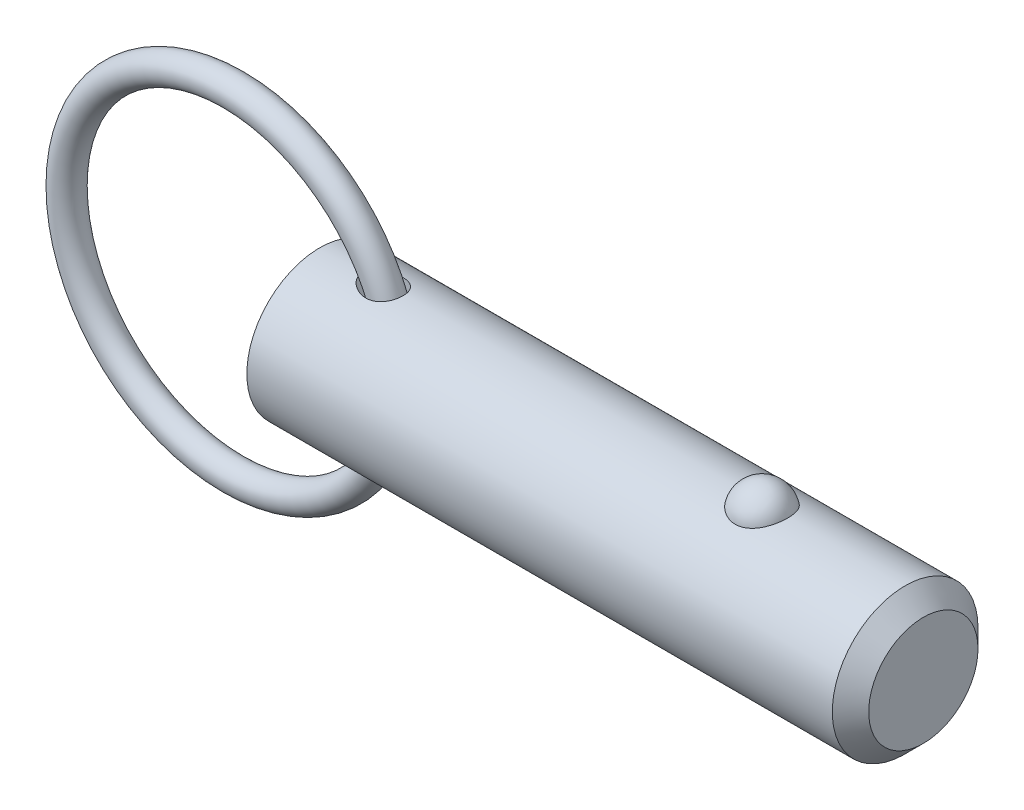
ISO-10303-21;
HEADER;
FILE_DESCRIPTION(('STEP AP214'),'2;1');
FILE_NAME('part.step','',(''),(''),'','','');
FILE_SCHEMA(('AUTOMOTIVE_DESIGN { 1 0 10303 214 1 1 1 1 }'));
ENDSEC;
DATA;
#1=APPLICATION_CONTEXT('core data for automotive mechanical design processes');
#2=APPLICATION_PROTOCOL_DEFINITION('international standard','automotive_design',2000,#1);
#3=PRODUCT_CONTEXT('',#1,'mechanical');
#4=PRODUCT('Part','Part','',(#3));
#5=PRODUCT_RELATED_PRODUCT_CATEGORY('part','',(#4));
#6=PRODUCT_DEFINITION_FORMATION('','',#4);
#7=PRODUCT_DEFINITION_CONTEXT('part definition',#1,'design');
#8=PRODUCT_DEFINITION('design','',#6,#7);
#9=PRODUCT_DEFINITION_SHAPE('','',#8);
#10=(LENGTH_UNIT() NAMED_UNIT(*) SI_UNIT(.MILLI.,.METRE.));
#11=(NAMED_UNIT(*) PLANE_ANGLE_UNIT() SI_UNIT($,.RADIAN.));
#12=(NAMED_UNIT(*) SI_UNIT($,.STERADIAN.) SOLID_ANGLE_UNIT());
#13=UNCERTAINTY_MEASURE_WITH_UNIT(LENGTH_MEASURE(1.E-05),#10,'distance_accuracy_value','');
#14=(GEOMETRIC_REPRESENTATION_CONTEXT(3) GLOBAL_UNCERTAINTY_ASSIGNED_CONTEXT((#13)) GLOBAL_UNIT_ASSIGNED_CONTEXT((#10,
#11,#12)) REPRESENTATION_CONTEXT('',''));
#15=CARTESIAN_POINT('',(0.,0.,0.));
#16=DIRECTION('',(0.,0.,1.));
#17=DIRECTION('',(1.,0.,0.));
#18=AXIS2_PLACEMENT_3D('',#15,#16,#17);
#19=CARTESIAN_POINT('',(-6.5973878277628,0.,0.));
#20=DIRECTION('',(0.,0.,1.));
#21=DIRECTION('',(1.,0.,0.));
#22=AXIS2_PLACEMENT_3D('',#19,#20,#21);
#23=TOROIDAL_SURFACE('',#22,12.7,1.111);
#24=CARTESIAN_POINT('',(7.21361217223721,0.,0.));
#25=VERTEX_POINT('',#24);
#26=VERTEX_LOOP('',#25);
#27=FACE_BOUND('',#26,.T.);
#28=ADVANCED_FACE('P0_F12',(#27),#23,.T.);
#29=CLOSED_SHELL('',(#28));
#30=MANIFOLD_SOLID_BREP('P0_B1',#29);
#31=CARTESIAN_POINT('',(0.,0.,0.));
#32=DIRECTION('',(1.,0.,0.));
#33=DIRECTION('',(0.,0.,-1.));
#34=AXIS2_PLACEMENT_3D('',#31,#32,#33);
#35=CYLINDRICAL_SURFACE('',#34,5.555);
#36=CARTESIAN_POINT('',(3.40796299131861,5.52646850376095,-0.562290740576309));
#37=CARTESIAN_POINT('',(3.45038002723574,5.51879026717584,-0.637753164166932));
#38=CARTESIAN_POINT('',(3.50032814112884,5.50998541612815,-0.70889136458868));
#39=CARTESIAN_POINT('',(3.61174203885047,5.49132550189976,-0.841353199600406));
#40=CARTESIAN_POINT('',(3.67323300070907,5.48146816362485,-0.90265482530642));
#41=CARTESIAN_POINT('',(3.80437942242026,5.46186986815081,-1.01449227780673));
#42=CARTESIAN_POINT('',(3.87396236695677,5.45212862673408,-1.06511378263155));
#43=CARTESIAN_POINT('',(4.01965973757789,5.43359578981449,-1.15594541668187));
#44=CARTESIAN_POINT('',(4.09577226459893,5.42480391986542,-1.19615855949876));
#45=CARTESIAN_POINT('',(4.26620236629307,5.40764958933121,-1.27165209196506));
#46=CARTESIAN_POINT('',(4.36143030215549,5.3996073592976,-1.30496908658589));
#47=CARTESIAN_POINT('',(4.55632904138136,5.38707461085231,-1.35578120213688));
#48=CARTESIAN_POINT('',(4.65600230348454,5.38258608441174,-1.37326745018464));
#49=CARTESIAN_POINT('',(4.85802759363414,5.37803111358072,-1.3910078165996));
#50=CARTESIAN_POINT('',(4.96039620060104,5.37800782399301,-1.39109376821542));
#51=CARTESIAN_POINT('',(5.1632196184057,5.38288845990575,-1.37209481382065));
#52=CARTESIAN_POINT('',(5.26367660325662,5.38778639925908,-1.3530331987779));
#53=CARTESIAN_POINT('',(5.44616808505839,5.40112654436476,-1.29866014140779));
#54=CARTESIAN_POINT('',(5.52893514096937,5.40904875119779,-1.26567968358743));
#55=CARTESIAN_POINT('',(5.68656142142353,5.4273273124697,-1.18484144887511));
#56=CARTESIAN_POINT('',(5.76142575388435,5.43768208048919,-1.13699336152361));
#57=CARTESIAN_POINT('',(5.89283785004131,5.45821422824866,-1.03362464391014));
#58=CARTESIAN_POINT('',(5.95048930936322,5.4682911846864,-0.979480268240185));
#59=CARTESIAN_POINT('',(6.05543937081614,5.48805232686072,-0.861887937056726));
#60=CARTESIAN_POINT('',(6.10274018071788,5.4977365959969,-0.798441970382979));
#61=CARTESIAN_POINT('',(6.18429732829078,5.51527779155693,-0.666351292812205));
#62=CARTESIAN_POINT('',(6.21893047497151,5.52318421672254,-0.597945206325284));
#63=CARTESIAN_POINT('',(6.27643902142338,5.53669785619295,-0.456146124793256));
#64=CARTESIAN_POINT('',(6.29931470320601,5.54230512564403,-0.382753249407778));
#65=CARTESIAN_POINT('',(6.33280284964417,5.55061821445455,-0.23299976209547));
#66=CARTESIAN_POINT('',(6.3434049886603,5.55332159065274,-0.156636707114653));
#67=CARTESIAN_POINT('',(6.35208224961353,5.55552923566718,-0.0031547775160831));
#68=CARTESIAN_POINT('',(6.35015703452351,5.55503341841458,0.0739641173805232));
#69=CARTESIAN_POINT('',(6.33379320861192,5.55088854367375,0.227029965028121));
#70=CARTESIAN_POINT('',(6.31931424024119,5.54722931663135,0.302972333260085));
#71=CARTESIAN_POINT('',(6.27810810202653,5.53713917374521,0.451265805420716));
#72=CARTESIAN_POINT('',(6.25138106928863,5.53070828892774,0.523616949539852));
#73=CARTESIAN_POINT('',(6.18634700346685,5.51578851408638,0.662556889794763));
#74=CARTESIAN_POINT('',(6.14805666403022,5.50730259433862,0.729153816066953));
#75=CARTESIAN_POINT('',(6.06084171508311,5.4892059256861,0.854797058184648));
#76=CARTESIAN_POINT('',(6.01191805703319,5.47959527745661,0.913844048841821));
#77=CARTESIAN_POINT('',(5.90496974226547,5.46035411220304,1.0225462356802));
#78=CARTESIAN_POINT('',(5.84698163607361,5.45072382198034,1.07223745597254));
#79=CARTESIAN_POINT('',(5.72342907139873,5.43245016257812,1.16128533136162));
#80=CARTESIAN_POINT('',(5.657864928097,5.42380675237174,1.20064241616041));
#81=CARTESIAN_POINT('',(5.5203318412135,5.40830592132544,1.26865612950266));
#82=CARTESIAN_POINT('',(5.44830127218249,5.40146883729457,1.2971923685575));
#83=CARTESIAN_POINT('',(5.30051649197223,5.39032432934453,1.34275086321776));
#84=CARTESIAN_POINT('',(5.22476137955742,5.38601752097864,1.35977031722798));
#85=CARTESIAN_POINT('',(5.06697568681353,5.38004503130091,1.3832203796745));
#86=CARTESIAN_POINT('',(4.98483834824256,5.37854992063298,1.38896799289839));
#87=CARTESIAN_POINT('',(4.82062075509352,5.37866467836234,1.38851901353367));
#88=CARTESIAN_POINT('',(4.73854053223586,5.38027567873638,1.38231806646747));
#89=CARTESIAN_POINT('',(4.56659703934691,5.38661928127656,1.35740374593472));
#90=CARTESIAN_POINT('',(4.47694676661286,5.39169506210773,1.33731128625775));
#91=CARTESIAN_POINT('',(4.30168169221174,5.40457769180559,1.28425210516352));
#92=CARTESIAN_POINT('',(4.21607146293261,5.41238755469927,1.25127117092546));
#93=CARTESIAN_POINT('',(4.04117722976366,5.43085841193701,1.16867508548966));
#94=CARTESIAN_POINT('',(3.95261220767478,5.44174460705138,1.11757796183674));
#95=CARTESIAN_POINT('',(3.78568183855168,5.46440376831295,1.00091858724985));
#96=CARTESIAN_POINT('',(3.70730710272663,5.47617590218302,0.935369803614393));
#97=CARTESIAN_POINT('',(3.58299379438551,5.49603821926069,0.809043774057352));
#98=CARTESIAN_POINT('',(3.53390203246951,5.50429522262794,0.751392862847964));
#99=CARTESIAN_POINT('',(3.44556991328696,5.51963490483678,0.628847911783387));
#100=CARTESIAN_POINT('',(3.4063138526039,5.52671944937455,0.563965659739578));
#101=CARTESIAN_POINT('',(3.34553998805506,5.5379053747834,0.439181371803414));
#102=CARTESIAN_POINT('',(3.32216705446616,5.5423057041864,0.380214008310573));
#103=CARTESIAN_POINT('',(3.2854368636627,5.54928356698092,0.259119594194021));
#104=CARTESIAN_POINT('',(3.27207322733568,5.5518622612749,0.196994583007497));
#105=CARTESIAN_POINT('',(3.25633559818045,5.5549036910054,0.0710541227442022));
#106=CARTESIAN_POINT('',(3.25400356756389,5.5553583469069,0.0072331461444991));
#107=CARTESIAN_POINT('',(3.26064251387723,5.55407150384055,-0.119787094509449));
#108=CARTESIAN_POINT('',(3.26961302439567,5.55233009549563,-0.182986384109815));
#109=CARTESIAN_POINT('',(3.29666795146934,5.54714559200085,-0.300518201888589));
#110=CARTESIAN_POINT('',(3.31373453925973,5.54389322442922,-0.355099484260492));
#111=CARTESIAN_POINT('',(3.35543396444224,5.53607951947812,-0.461174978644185));
#112=CARTESIAN_POINT('',(3.38007019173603,5.5315175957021,-0.512667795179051));
#113=CARTESIAN_POINT('',(3.40796299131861,5.52646850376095,-0.562290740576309));
#114=B_SPLINE_CURVE_WITH_KNOTS('',3,(#36,#37,#38,#39,#40,#41,#42,#43,#44,#45,#46,#47,#48,#49,
#50,#51,#52,#53,#54,#55,#56,#57,#58,#59,#60,#61,#62,#63,#64,#65,#66,#67,#68,#69,#70,#71,#72,#73,
#74,#75,#76,#77,#78,#79,#80,#81,#82,#83,#84,#85,#86,#87,#88,#89,#90,#91,#92,#93,#94,#95,#96,#97,
#98,#99,#100,#101,#102,#103,#104,#105,#106,#107,#108,#109,#110,#111,#112,#113),.UNSPECIFIED.,
.T.,.F.,(4,2,2,2,2,2,2,2,2,2,2,2,2,2,2,2,2,2,2,2,2,2,2,2,2,2,2,2,2,2,2,2,2,2,2,2,2,2,4),(0.,
0.260459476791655,0.52149382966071,0.780346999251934,1.03912513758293,1.34137402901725,
1.64379222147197,1.94913302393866,2.25410286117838,2.52092363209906,2.78757087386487,
3.02557563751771,3.26352958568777,3.49368251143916,3.72382991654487,3.9541708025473,
4.18451788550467,4.41560824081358,4.64669600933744,4.87745174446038,5.10818684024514,
5.33801446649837,5.56783253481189,5.80013729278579,6.03249854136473,6.27855081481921,
6.5246927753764,6.79963372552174,7.07487872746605,7.38193573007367,7.68870779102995,
7.91639390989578,8.14371416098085,8.33366541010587,8.52349549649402,8.71404708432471,
8.90459080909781,9.07578823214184,9.24706243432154),.UNSPECIFIED.);
#115=CARTESIAN_POINT('',(3.40796299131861,5.52646850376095,-0.562290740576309));
#116=VERTEX_POINT('',#115);
#117=EDGE_CURVE('P1_E40',#116,#116,#114,.T.);
#118=ORIENTED_EDGE('',*,*,#117,.T.);
#119=EDGE_LOOP('',(#118));
#120=FACE_BOUND('',#119,.T.);
#121=CARTESIAN_POINT('',(44.63125,0.,0.));
#122=DIRECTION('',(1.,0.,0.));
#123=DIRECTION('',(0.,0.,-1.));
#124=AXIS2_PLACEMENT_3D('',#121,#122,#123);
#125=CIRCLE('',#124,5.555);
#126=CARTESIAN_POINT('',(44.63125,0.,-5.555));
#127=VERTEX_POINT('',#126);
#128=EDGE_CURVE('P1_E25',#127,#127,#125,.T.);
#129=ORIENTED_EDGE('',*,*,#128,.F.);
#130=EDGE_LOOP('',(#129));
#131=FACE_BOUND('',#130,.T.);
#132=CARTESIAN_POINT('',(0.,0.,0.));
#133=DIRECTION('',(1.,0.,0.));
#134=DIRECTION('',(0.,0.,-1.));
#135=AXIS2_PLACEMENT_3D('',#132,#133,#134);
#136=CIRCLE('',#135,5.555);
#137=CARTESIAN_POINT('',(0.,0.,-5.555));
#138=VERTEX_POINT('',#137);
#139=EDGE_CURVE('P1_E9',#138,#138,#136,.T.);
#140=ORIENTED_EDGE('',*,*,#139,.T.);
#141=EDGE_LOOP('',(#140));
#142=FACE_BOUND('',#141,.T.);
#143=CARTESIAN_POINT('',(33.7186264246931,5.16741224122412,2.03859650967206));
#144=CARTESIAN_POINT('',(33.6129492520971,5.16740893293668,2.03859990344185));
#145=CARTESIAN_POINT('',(33.50729894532,5.17079470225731,2.03008306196));
#146=CARTESIAN_POINT('',(33.2991419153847,5.18392795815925,1.99630721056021));
#147=CARTESIAN_POINT('',(33.1966344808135,5.19367399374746,1.97105201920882));
#148=CARTESIAN_POINT('',(32.9977710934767,5.21839168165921,1.90463997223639));
#149=CARTESIAN_POINT('',(32.9014064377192,5.23335573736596,1.86350622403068));
#150=CARTESIAN_POINT('',(32.7170804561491,5.26688076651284,1.76652592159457));
#151=CARTESIAN_POINT('',(32.6291207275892,5.28544242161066,1.71067657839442));
#152=CARTESIAN_POINT('',(32.461265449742,5.32479845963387,1.58399959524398));
#153=CARTESIAN_POINT('',(32.3816656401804,5.34564089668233,1.51279545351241));
#154=CARTESIAN_POINT('',(32.2351290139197,5.38697258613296,1.3582858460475));
#155=CARTESIAN_POINT('',(32.168194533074,5.40746177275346,1.27497815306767));
#156=CARTESIAN_POINT('',(32.0456103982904,5.44694508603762,1.09440293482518));
#157=CARTESIAN_POINT('',(31.9905989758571,5.46583143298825,0.996677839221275));
#158=CARTESIAN_POINT('',(31.8969376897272,5.49908030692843,0.792961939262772));
#159=CARTESIAN_POINT('',(31.8582894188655,5.513442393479,0.686970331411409));
#160=CARTESIAN_POINT('',(31.7976807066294,5.536358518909,0.468019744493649));
#161=CARTESIAN_POINT('',(31.7759725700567,5.54482455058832,0.3549815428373));
#162=CARTESIAN_POINT('',(31.7506362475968,5.55473324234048,0.126595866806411));
#163=CARTESIAN_POINT('',(31.7470077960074,5.55617600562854,0.0112484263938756));
#164=CARTESIAN_POINT('',(31.7578817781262,5.55189984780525,-0.218011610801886));
#165=CARTESIAN_POINT('',(31.7723151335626,5.54620821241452,-0.331928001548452));
#166=CARTESIAN_POINT('',(31.818903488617,5.52828920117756,-0.555544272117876));
#167=CARTESIAN_POINT('',(31.8510588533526,5.5160616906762,-0.665244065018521));
#168=CARTESIAN_POINT('',(31.9324883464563,5.48630779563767,-0.877469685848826));
#169=CARTESIAN_POINT('',(31.9817816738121,5.4687754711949,-0.979987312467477));
#170=CARTESIAN_POINT('',(32.0964785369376,5.43024700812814,-1.1748697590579));
#171=CARTESIAN_POINT('',(32.1618831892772,5.4092506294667,-1.26723387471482));
#172=CARTESIAN_POINT('',(32.3075712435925,5.36600927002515,-1.4394013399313));
#173=CARTESIAN_POINT('',(32.3878859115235,5.34376173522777,-1.51917763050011));
#174=CARTESIAN_POINT('',(32.5614520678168,5.30057971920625,-1.66360338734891));
#175=CARTESIAN_POINT('',(32.654702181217,5.27964509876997,-1.72825445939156));
#176=CARTESIAN_POINT('',(32.8493939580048,5.24205250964,-1.83909478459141));
#177=CARTESIAN_POINT('',(32.9505900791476,5.22530519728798,-1.88568407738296));
#178=CARTESIAN_POINT('',(33.1601552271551,5.19750919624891,-1.96100802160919));
#179=CARTESIAN_POINT('',(33.2685215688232,5.1864583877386,-1.98974931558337));
#180=CARTESIAN_POINT('',(33.4834989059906,5.17184410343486,-2.02742262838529));
#181=CARTESIAN_POINT('',(33.589925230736,5.1679328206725,-2.03727608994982));
#182=CARTESIAN_POINT('',(33.8029925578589,5.16698995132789,-2.03966777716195));
#183=CARTESIAN_POINT('',(33.9096335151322,5.16995704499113,-2.03220932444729));
#184=CARTESIAN_POINT('',(34.1167730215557,5.18222383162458,-2.00071170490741));
#185=CARTESIAN_POINT('',(34.2173599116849,5.19133213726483,-1.97717337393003));
#186=CARTESIAN_POINT('',(34.4130141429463,5.21467637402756,-1.91475248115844));
#187=CARTESIAN_POINT('',(34.5080810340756,5.22891272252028,-1.8758686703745));
#188=CARTESIAN_POINT('',(34.6923711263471,5.26137066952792,-1.7828271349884));
#189=CARTESIAN_POINT('',(34.7814190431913,5.27967329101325,-1.72835124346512));
#190=CARTESIAN_POINT('',(34.9492880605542,5.3181741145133,-1.6059748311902));
#191=CARTESIAN_POINT('',(35.0281068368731,5.33837274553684,-1.53807126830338));
#192=CARTESIAN_POINT('',(35.1775156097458,5.37968287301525,-1.38688970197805));
#193=CARTESIAN_POINT('',(35.2475058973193,5.40079011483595,-1.30301744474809));
#194=CARTESIAN_POINT('',(35.3730125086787,5.44074401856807,-1.12458170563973));
#195=CARTESIAN_POINT('',(35.4285262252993,5.4595902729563,-1.0300163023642));
#196=CARTESIAN_POINT('',(35.5255507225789,5.49369849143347,-0.829439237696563));
#197=CARTESIAN_POINT('',(35.5665483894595,5.50882422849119,-0.723155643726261));
#198=CARTESIAN_POINT('',(35.6311250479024,5.53310911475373,-0.504772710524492));
#199=CARTESIAN_POINT('',(35.6547036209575,5.54226812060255,-0.392673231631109));
#200=CARTESIAN_POINT('',(35.684013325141,5.55370358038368,-0.165459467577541));
#201=CARTESIAN_POINT('',(35.6896884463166,5.55595843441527,-0.050336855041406));
#202=CARTESIAN_POINT('',(35.682916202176,5.55329317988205,0.179288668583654));
#203=CARTESIAN_POINT('',(35.6704690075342,5.54837313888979,0.293791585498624));
#204=CARTESIAN_POINT('',(35.6277798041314,5.53189037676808,0.518526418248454));
#205=CARTESIAN_POINT('',(35.597598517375,5.5203503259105,0.62877154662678));
#206=CARTESIAN_POINT('',(35.5200962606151,5.49182453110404,0.84231815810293));
#207=CARTESIAN_POINT('',(35.4727743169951,5.47483847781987,0.945619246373));
#208=CARTESIAN_POINT('',(35.3617204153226,5.43710633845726,1.14281571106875));
#209=CARTESIAN_POINT('',(35.2979215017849,5.41634501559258,1.23667048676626));
#210=CARTESIAN_POINT('',(35.1553577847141,5.37334572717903,1.41185243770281));
#211=CARTESIAN_POINT('',(35.0765932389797,5.35110778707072,1.4931798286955));
#212=CARTESIAN_POINT('',(34.9064234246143,5.30779474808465,1.64049162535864));
#213=CARTESIAN_POINT('',(34.8151002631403,5.28671324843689,1.70656877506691));
#214=CARTESIAN_POINT('',(34.6217390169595,5.24804852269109,1.82201372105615));
#215=CARTESIAN_POINT('',(34.5197005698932,5.23046541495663,1.87138095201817));
#216=CARTESIAN_POINT('',(34.3036187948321,5.20042692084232,1.95335298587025));
#217=CARTESIAN_POINT('',(34.1892602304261,5.18820192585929,1.98521734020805));
#218=CARTESIAN_POINT('',(33.9561307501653,5.17169804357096,2.02783294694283));
#219=CARTESIAN_POINT('',(33.8373616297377,5.16741595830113,2.03859269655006));
#220=CARTESIAN_POINT('',(33.7186264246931,5.16741224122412,2.03859650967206));
#221=B_SPLINE_CURVE_WITH_KNOTS('',3,(#143,#144,#145,#146,#147,#148,#149,#150,#151,#152,#153,
#154,#155,#156,#157,#158,#159,#160,#161,#162,#163,#164,#165,#166,#167,#168,#169,#170,#171,#172,
#173,#174,#175,#176,#177,#178,#179,#180,#181,#182,#183,#184,#185,#186,#187,#188,#189,#190,#191,
#192,#193,#194,#195,#196,#197,#198,#199,#200,#201,#202,#203,#204,#205,#206,#207,#208,#209,#210,
#211,#212,#213,#214,#215,#216,#217,#218,#219,#220),.UNSPECIFIED.,.T.,.F.,(4,2,2,2,2,2,2,2,2,2,2,
2,2,2,2,2,2,2,2,2,2,2,2,2,2,2,2,2,2,2,2,2,2,2,2,2,2,2,4),(0.,0.316595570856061,
0.633118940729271,0.949183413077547,1.26530783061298,1.59030762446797,1.9153672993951,
2.25495824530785,2.59458224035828,2.93917283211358,3.28375835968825,3.62703002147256,
3.97030875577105,4.31397329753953,4.657661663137,5.00207904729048,5.34645984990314,
5.68270547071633,6.01882587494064,6.33808403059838,6.65728093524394,6.96696376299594,
7.27667180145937,7.59321535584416,7.90983070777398,8.2421038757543,8.5744368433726,
8.9175589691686,9.2606893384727,9.60489211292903,9.94909164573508,10.2921194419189,
10.6351667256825,10.9796305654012,11.3240884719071,11.6663928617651,12.0087088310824,
12.3645679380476,12.7202837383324),.UNSPECIFIED.);
#222=CARTESIAN_POINT('',(33.7186264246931,5.16741224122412,2.03859650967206));
#223=VERTEX_POINT('',#222);
#224=EDGE_CURVE('P1_E34',#223,#223,#221,.T.);
#225=ORIENTED_EDGE('',*,*,#224,.T.);
#226=EDGE_LOOP('',(#225));
#227=FACE_BOUND('',#226,.T.);
#228=CARTESIAN_POINT('',(3.40796299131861,-5.52646850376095,-0.562290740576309));
#229=CARTESIAN_POINT('',(3.37716927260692,-5.53204268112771,-0.507507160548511));
#230=CARTESIAN_POINT('',(3.35034276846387,-5.53702335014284,-0.450440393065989));
#231=CARTESIAN_POINT('',(3.30606625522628,-5.54534377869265,-0.332655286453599));
#232=CARTESIAN_POINT('',(3.28860803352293,-5.5486849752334,-0.271940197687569));
#233=CARTESIAN_POINT('',(3.2642120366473,-5.55337514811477,-0.148013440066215));
#234=CARTESIAN_POINT('',(3.25732647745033,-5.55471423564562,-0.0847909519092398));
#235=CARTESIAN_POINT('',(3.25480623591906,-5.5552029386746,0.0418913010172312));
#236=CARTESIAN_POINT('',(3.25917102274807,-5.55435265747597,0.105351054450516));
#237=CARTESIAN_POINT('',(3.27824306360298,-5.55067444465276,0.227039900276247));
#238=CARTESIAN_POINT('',(3.29237198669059,-5.54795714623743,0.285365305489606));
#239=CARTESIAN_POINT('',(3.32941044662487,-5.54094262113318,0.399033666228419));
#240=CARTESIAN_POINT('',(3.35232235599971,-5.53664496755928,0.454375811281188));
#241=CARTESIAN_POINT('',(3.40768868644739,-5.52648234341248,0.565099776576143));
#242=CARTESIAN_POINT('',(3.44072521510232,-5.52052470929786,0.620179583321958));
#243=CARTESIAN_POINT('',(3.51400705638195,-5.50771567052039,0.725188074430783));
#244=CARTESIAN_POINT('',(3.55425830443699,-5.50086353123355,0.775112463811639));
#245=CARTESIAN_POINT('',(3.66122818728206,-5.48337209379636,0.89197701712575));
#246=CARTESIAN_POINT('',(3.73142715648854,-5.47248221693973,0.955709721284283));
#247=CARTESIAN_POINT('',(3.88137100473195,-5.45112279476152,1.07085228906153));
#248=CARTESIAN_POINT('',(3.9611304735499,-5.44065392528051,1.12224294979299));
#249=CARTESIAN_POINT('',(4.12858826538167,-5.42121387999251,1.21269344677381));
#250=CARTESIAN_POINT('',(4.21635930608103,-5.41225908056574,1.25162207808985));
#251=CARTESIAN_POINT('',(4.39702156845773,-5.39704895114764,1.31566440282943));
#252=CARTESIAN_POINT('',(4.48991226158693,-5.39079334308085,1.34077951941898));
#253=CARTESIAN_POINT('',(4.68604255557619,-5.38154547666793,1.37745897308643));
#254=CARTESIAN_POINT('',(4.78952677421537,-5.37884317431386,1.38782444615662));
#255=CARTESIAN_POINT('',(4.9967070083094,-5.3783992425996,1.38955482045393));
#256=CARTESIAN_POINT('',(5.10040282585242,-5.380654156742,1.380932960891));
#257=CARTESIAN_POINT('',(5.29344112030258,-5.3896561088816,1.34533259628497));
#258=CARTESIAN_POINT('',(5.38316618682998,-5.39591960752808,1.32032381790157));
#259=CARTESIAN_POINT('',(5.55593681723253,-5.41176992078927,1.25376768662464));
#260=CARTESIAN_POINT('',(5.63898852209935,-5.42135363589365,1.2122357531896));
#261=CARTESIAN_POINT('',(5.78518175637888,-5.4411584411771,1.1197110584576));
#262=CARTESIAN_POINT('',(5.84951468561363,-5.45115126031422,1.07054233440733));
#263=CARTESIAN_POINT('',(5.9683236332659,-5.47143247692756,0.961516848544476));
#264=CARTESIAN_POINT('',(6.0228023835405,-5.48172079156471,0.901663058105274));
#265=CARTESIAN_POINT('',(6.11773365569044,-5.50082367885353,0.776380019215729));
#266=CARTESIAN_POINT('',(6.15876077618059,-5.50968670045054,0.711392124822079));
#267=CARTESIAN_POINT('',(6.22940016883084,-5.52555592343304,0.575278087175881));
#268=CARTESIAN_POINT('',(6.25901321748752,-5.53256225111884,0.504152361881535));
#269=CARTESIAN_POINT('',(6.30603044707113,-5.54392803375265,0.358090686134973));
#270=CARTESIAN_POINT('',(6.32348246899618,-5.54829785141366,0.283170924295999));
#271=CARTESIAN_POINT('',(6.34598368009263,-5.5539654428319,0.131376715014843));
#272=CARTESIAN_POINT('',(6.35103253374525,-5.55526313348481,0.0545022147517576));
#273=CARTESIAN_POINT('',(6.3486124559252,-5.55464639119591,-0.0993401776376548));
#274=CARTESIAN_POINT('',(6.34109421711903,-5.5527193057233,-0.176307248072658));
#275=CARTESIAN_POINT('',(6.31360904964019,-5.54583593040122,-0.327847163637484));
#276=CARTESIAN_POINT('',(6.29364207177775,-5.54087962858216,-0.40241999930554));
#277=CARTESIAN_POINT('',(6.24170966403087,-5.52847553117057,-0.547041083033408));
#278=CARTESIAN_POINT('',(6.20974488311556,-5.52102787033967,-0.617089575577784));
#279=CARTESIAN_POINT('',(6.13458425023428,-5.5044595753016,-0.750655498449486));
#280=CARTESIAN_POINT('',(6.09138916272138,-5.49533905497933,-0.814173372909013));
#281=CARTESIAN_POINT('',(5.99508306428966,-5.47647644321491,-0.932642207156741));
#282=CARTESIAN_POINT('',(5.9420128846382,-5.46673701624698,-0.98762679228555));
#283=CARTESIAN_POINT('',(5.8273207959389,-5.4476756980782,-1.08787197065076));
#284=CARTESIAN_POINT('',(5.76569959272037,-5.43835377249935,-1.133133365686));
#285=CARTESIAN_POINT('',(5.63545565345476,-5.42108746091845,-1.2130627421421));
#286=CARTESIAN_POINT('',(5.56680798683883,-5.41314827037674,-1.24769112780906));
#287=CARTESIAN_POINT('',(5.42470366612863,-5.39946749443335,-1.30562834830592));
#288=CARTESIAN_POINT('',(5.35124627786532,-5.39372624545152,-1.32893545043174));
#289=CARTESIAN_POINT('',(5.19834649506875,-5.38471871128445,-1.36498831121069));
#290=CARTESIAN_POINT('',(5.11878242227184,-5.38156800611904,-1.37724301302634));
#291=CARTESIAN_POINT('',(4.95867408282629,-5.37830368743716,-1.38993264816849));
#292=CARTESIAN_POINT('',(4.87812945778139,-5.37819121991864,-1.39036312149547));
#293=CARTESIAN_POINT('',(4.70952450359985,-5.38096665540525,-1.37958681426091));
#294=CARTESIAN_POINT('',(4.62154757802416,-5.38416579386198,-1.36717293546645));
#295=CARTESIAN_POINT('',(4.44844201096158,-5.39350862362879,-1.32983172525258));
#296=CARTESIAN_POINT('',(4.36331534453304,-5.39965431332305,-1.30489590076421));
#297=CARTESIAN_POINT('',(4.18705584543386,-5.41508127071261,-1.23943340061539));
#298=CARTESIAN_POINT('',(4.09653169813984,-5.42466147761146,-1.19732979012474));
#299=CARTESIAN_POINT('',(3.92355621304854,-5.44542654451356,-1.09903394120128));
#300=CARTESIAN_POINT('',(3.84111059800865,-5.45661252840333,-1.04283181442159));
#301=CARTESIAN_POINT('',(3.69303712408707,-5.47835672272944,-0.921492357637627));
#302=CARTESIAN_POINT('',(3.62661543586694,-5.4888999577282,-0.857326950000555));
#303=CARTESIAN_POINT('',(3.50663841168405,-5.50887375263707,-0.717815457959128));
#304=CARTESIAN_POINT('',(3.45304856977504,-5.51830726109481,-0.642500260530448));
#305=CARTESIAN_POINT('',(3.40796299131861,-5.52646850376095,-0.562290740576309));
#306=B_SPLINE_CURVE_WITH_KNOTS('',3,(#228,#229,#230,#231,#232,#233,#234,#235,#236,#237,#238,
#239,#240,#241,#242,#243,#244,#245,#246,#247,#248,#249,#250,#251,#252,#253,#254,#255,#256,#257,
#258,#259,#260,#261,#262,#263,#264,#265,#266,#267,#268,#269,#270,#271,#272,#273,#274,#275,#276,
#277,#278,#279,#280,#281,#282,#283,#284,#285,#286,#287,#288,#289,#290,#291,#292,#293,#294,#295,
#296,#297,#298,#299,#300,#301,#302,#303,#304,#305),.UNSPECIFIED.,.T.,.F.,(4,2,2,2,2,2,2,2,2,2,2,
2,2,2,2,2,2,2,2,2,2,2,2,2,2,2,2,2,2,2,2,2,2,2,2,2,2,2,4),(0.,0.18905429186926,0.377942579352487,
0.567760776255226,0.757570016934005,0.937004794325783,1.11648807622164,1.30929480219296,
1.50226088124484,1.78704908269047,2.07227755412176,2.3604171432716,2.64852704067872,
2.95892962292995,3.26911584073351,3.5475451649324,3.82571526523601,4.06921935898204,
4.31265584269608,4.54364944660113,4.77462733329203,5.00469135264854,5.234761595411,
5.46573664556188,5.69671260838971,5.92767607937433,6.15862383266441,6.38863707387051,
6.61863134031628,6.84947196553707,7.08034790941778,7.32103794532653,7.56181876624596,
7.82747997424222,8.09332161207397,8.39289891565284,8.69268692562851,8.97023931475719,
9.24703674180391),.UNSPECIFIED.);
#307=CARTESIAN_POINT('',(3.40796299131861,-5.52646850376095,-0.562290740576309));
#308=VERTEX_POINT('',#307);
#309=EDGE_CURVE('P1_E17',#308,#308,#306,.T.);
#310=ORIENTED_EDGE('',*,*,#309,.T.);
#311=EDGE_LOOP('',(#310));
#312=FACE_BOUND('',#311,.T.);
#313=ADVANCED_FACE('P1_F13',(#120,#131,#142,#227,#312),#35,.T.);
#314=CARTESIAN_POINT('',(0.,0.,0.));
#315=DIRECTION('',(-1.,0.,0.));
#316=DIRECTION('',(0.,0.,1.));
#317=AXIS2_PLACEMENT_3D('',#314,#315,#316);
#318=PLANE('',#317);
#319=ORIENTED_EDGE('',*,*,#139,.F.);
#320=EDGE_LOOP('',(#319));
#321=FACE_BOUND('',#320,.T.);
#322=ADVANCED_FACE('P1_F15',(#321),#318,.T.);
#323=CARTESIAN_POINT('',(46.02,0.,0.));
#324=DIRECTION('',(-1.,0.,0.));
#325=DIRECTION('',(0.,0.,1.));
#326=AXIS2_PLACEMENT_3D('',#323,#324,#325);
#327=CONICAL_SURFACE('',#326,4.16625000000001,0.785398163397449);
#328=ORIENTED_EDGE('',*,*,#128,.T.);
#329=EDGE_LOOP('',(#328));
#330=FACE_BOUND('',#329,.T.);
#331=CARTESIAN_POINT('',(46.02,0.,0.));
#332=DIRECTION('',(1.,0.,0.));
#333=DIRECTION('',(0.,0.,-1.));
#334=AXIS2_PLACEMENT_3D('',#331,#332,#333);
#335=CIRCLE('',#334,4.16625000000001);
#336=CARTESIAN_POINT('',(46.02,0.,-4.16625000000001));
#337=VERTEX_POINT('',#336);
#338=EDGE_CURVE('P1_E30',#337,#337,#335,.T.);
#339=ORIENTED_EDGE('',*,*,#338,.F.);
#340=EDGE_LOOP('',(#339));
#341=FACE_BOUND('',#340,.T.);
#342=ADVANCED_FACE('P1_F55',(#330,#341),#327,.T.);
#343=CARTESIAN_POINT('',(46.02,4.16625000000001,0.));
#344=DIRECTION('',(1.,0.,0.));
#345=DIRECTION('',(0.,0.,-1.));
#346=AXIS2_PLACEMENT_3D('',#343,#344,#345);
#347=PLANE('',#346);
#348=ORIENTED_EDGE('',*,*,#338,.T.);
#349=EDGE_LOOP('',(#348));
#350=FACE_BOUND('',#349,.T.);
#351=ADVANCED_FACE('P1_F51',(#350),#347,.T.);
#352=CARTESIAN_POINT('',(33.7186264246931,4.9995,0.));
#353=DIRECTION('',(-1.,0.,0.));
#354=DIRECTION('',(0.,1.,0.));
#355=AXIS2_PLACEMENT_3D('',#352,#353,#354);
#356=SPHERICAL_SURFACE('',#355,2.04550000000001);
#357=ORIENTED_EDGE('',*,*,#224,.F.);
#358=EDGE_LOOP('',(#357));
#359=FACE_BOUND('',#358,.T.);
#360=ADVANCED_FACE('P1_F46',(#359),#356,.T.);
#361=CARTESIAN_POINT('',(-6.59738782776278,0.,0.));
#362=DIRECTION('',(0.,0.,1.));
#363=DIRECTION('',(1.,0.,0.));
#364=AXIS2_PLACEMENT_3D('',#361,#362,#363);
#365=TOROIDAL_SURFACE('',#364,12.7,1.38875);
#366=ORIENTED_EDGE('',*,*,#309,.F.);
#367=EDGE_LOOP('',(#366));
#368=FACE_BOUND('',#367,.T.);
#369=ORIENTED_EDGE('',*,*,#117,.F.);
#370=EDGE_LOOP('',(#369));
#371=FACE_BOUND('',#370,.T.);
#372=ADVANCED_FACE('P1_F50',(#368,#371),#365,.F.);
#373=CLOSED_SHELL('',(#313,#322,#342,#351,#360,#372));
#374=MANIFOLD_SOLID_BREP('P1_B1',#373);
#375=ADVANCED_BREP_SHAPE_REPRESENTATION('',(#18,#30,#374),#14);
#376=SHAPE_DEFINITION_REPRESENTATION(#9,#375);
ENDSEC;
END-ISO-10303-21;
